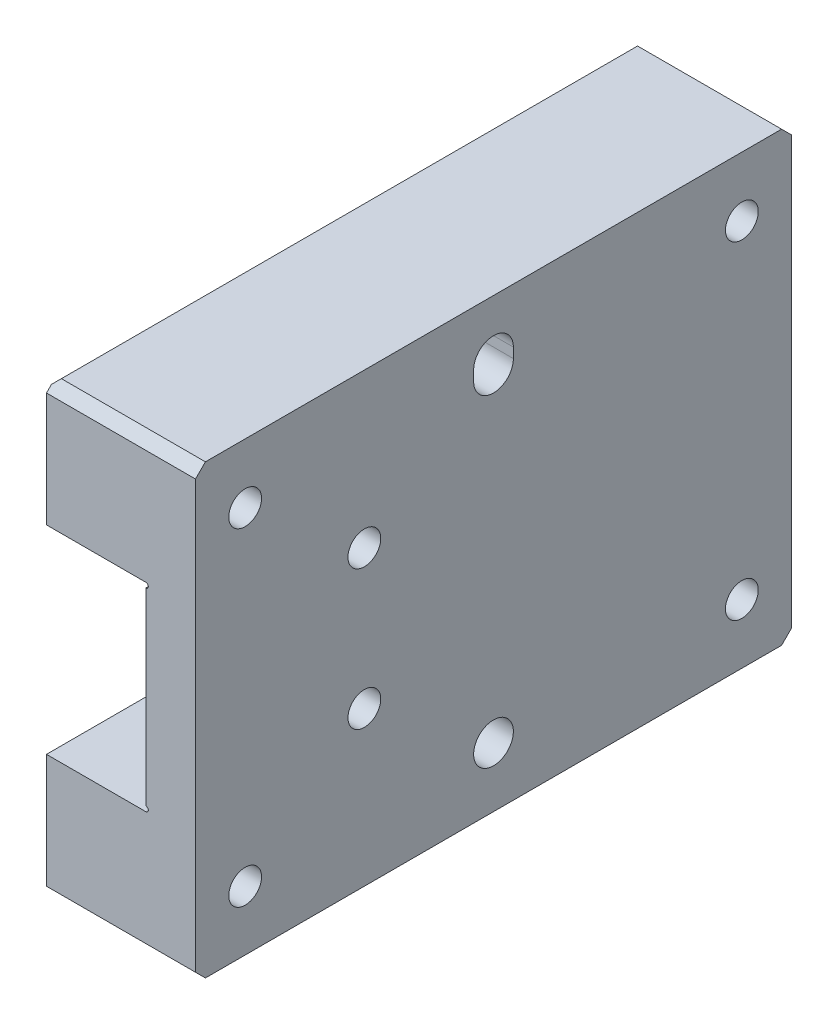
from build123d import *

# Parameters (mm, degrees)
SKETCH_1_W             = 15
SKETCH_1_H             = 45
EXTRUDE_1_DEPTH        = 60
SKETCH_2_W             = 60
SKETCH_2_H             = 20
CUT_EXTRUDE_1_DEPTH    = 10
CHAMFER_2_SIZE         = 0.5
SKETCH_12_R            = 0.25
CUT_EXTRUDE_2_DEPTH    = 65.517439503
HOLE_WIZARD_M4_1_D     = 3.3
F_4_0MM_1_D            = 4
CUT_EXTRUDE_3_DEPTH    = 66.812232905
CHAMFER_3_SIZE         = 1
HOLE_WIZARD_M4_2_D     = 3.3
HOLE_WIZARD_M4_2_DEPTH = 10.1
HOLE_WIZARD_M4_2_TIP   = 0.991420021


with BuildPart() as part:
    # Sketch 1 → Extrude 1 (new body)
    with BuildSketch(Plane.XY):
        Rectangle(SKETCH_1_W, SKETCH_1_H)
    extrude(amount=EXTRUDE_1_DEPTH)

    # Sketch 2 → Cut-Extrude 1 (cut)
    with BuildSketch(Plane.ZY.offset(7.5)):
        with Locations((30, 0)):
            Rectangle(SKETCH_2_W, SKETCH_2_H)
    extrude(amount=-CUT_EXTRUDE_1_DEPTH, mode=Mode.SUBTRACT)

    # Chamfer 2
    chamfer_2_edges = [part.edges().sort_by_distance(p)[0] for p in [
        (-7.5, -22.5, 30),
        (-7.5, 22.5, 30),
    ]]
    chamfer(chamfer_2_edges, length=CHAMFER_2_SIZE)

    # Sketch 12 → Cut-Extrude 2 (cut, through all)
    with BuildSketch(Plane.XY.offset(60)):
        with Locations((2.5, 9.75)):
            Circle(SKETCH_12_R)
        with Locations((2.5, -9.75)):
            Circle(SKETCH_12_R)
    extrude(amount=-CUT_EXTRUDE_2_DEPTH, mode=Mode.SUBTRACT)

    # Hole Wizard M4 _1 (through all)
    with Locations(Plane(origin=(7.5, 0, 0), x_dir=(0, 0, -1), z_dir=(1, 0, 0))):
        with Locations((-55, 16.5), (-5, 16.5), (-55, -16.5), (-5, -16.5)):
            Hole(HOLE_WIZARD_M4_1_D / 2)

    # 4.0mm _1 (through all)
    with Locations(Plane(origin=(7.5, 0, 0), x_dir=(0, 0, -1), z_dir=(1, 0, 0))):
        with Locations((-30, 16.5), (-30, -16.5)):
            Hole(F_4_0MM_1_D / 2)

    # Sketch 17 → Cut-Extrude 3 (cut, through all)
    with BuildSketch(Plane(origin=(7.5, 0, 0), x_dir=(0, 0, -1), z_dir=(1, 0, 0))):
        with BuildLine():
            Line((-28, 17), (-28, 16))
            ThreePointArc((-28, 16), (-30, 14), (-32, 16))
            Line((-32, 16), (-32, 17))
            ThreePointArc((-32, 17), (-30, 19), (-28, 17))
        make_face()
    extrude(amount=-CUT_EXTRUDE_3_DEPTH, mode=Mode.SUBTRACT)

    # Chamfer 3
    chamfer_3_edges = [part.edges().sort_by_distance(p)[0] for p in [
        (0.25, 22.5, 0),
        (0.25, -22.5, 0),
        (0.25, -22.5, 60),
        (0.25, 22.5, 60),
    ]]
    chamfer(chamfer_3_edges, length=CHAMFER_3_SIZE)

    # Hole Wizard M4 _2
    with Locations(Plane(origin=(7.5, 0, 0), x_dir=(0, 0, -1), z_dir=(1, 0, 0))):
        with Locations((-43, -7), (-43, 7)):
            Hole(HOLE_WIZARD_M4_2_D / 2, depth=HOLE_WIZARD_M4_2_DEPTH)
            with Locations((0, 0, -(HOLE_WIZARD_M4_2_DEPTH + HOLE_WIZARD_M4_2_TIP / 2))):  # 118° drill point
                Cone(0, HOLE_WIZARD_M4_2_D / 2, HOLE_WIZARD_M4_2_TIP, mode=Mode.SUBTRACT)


solid = part.part
